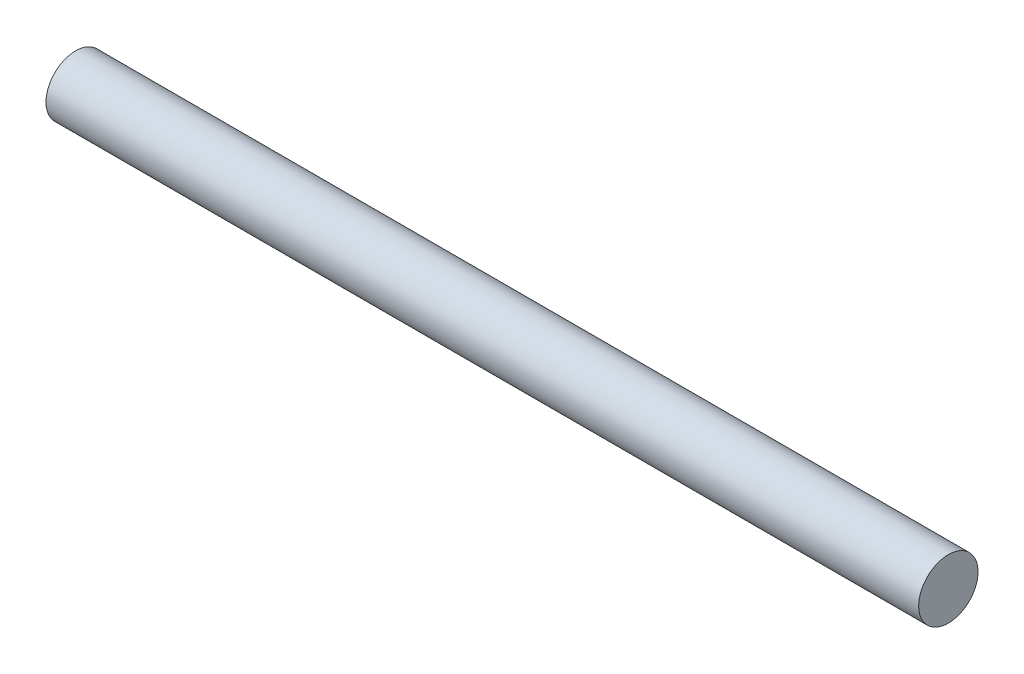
ISO-10303-21;
HEADER;
FILE_DESCRIPTION(('STEP AP214'),'2;1');
FILE_NAME('part.step','',(''),(''),'','','');
FILE_SCHEMA(('AUTOMOTIVE_DESIGN { 1 0 10303 214 1 1 1 1 }'));
ENDSEC;
DATA;
#1=APPLICATION_CONTEXT('core data for automotive mechanical design processes');
#2=APPLICATION_PROTOCOL_DEFINITION('international standard','automotive_design',2000,#1);
#3=PRODUCT_CONTEXT('',#1,'mechanical');
#4=PRODUCT('Part','Part','',(#3));
#5=PRODUCT_RELATED_PRODUCT_CATEGORY('part','',(#4));
#6=PRODUCT_DEFINITION_FORMATION('','',#4);
#7=PRODUCT_DEFINITION_CONTEXT('part definition',#1,'design');
#8=PRODUCT_DEFINITION('design','',#6,#7);
#9=PRODUCT_DEFINITION_SHAPE('','',#8);
#10=(LENGTH_UNIT() NAMED_UNIT(*) SI_UNIT(.MILLI.,.METRE.));
#11=(NAMED_UNIT(*) PLANE_ANGLE_UNIT() SI_UNIT($,.RADIAN.));
#12=(NAMED_UNIT(*) SI_UNIT($,.STERADIAN.) SOLID_ANGLE_UNIT());
#13=UNCERTAINTY_MEASURE_WITH_UNIT(LENGTH_MEASURE(1.E-05),#10,'distance_accuracy_value','');
#14=(GEOMETRIC_REPRESENTATION_CONTEXT(3) GLOBAL_UNCERTAINTY_ASSIGNED_CONTEXT((#13)) GLOBAL_UNIT_ASSIGNED_CONTEXT((#10,
#11,#12)) REPRESENTATION_CONTEXT('',''));
#15=CARTESIAN_POINT('',(0.,0.,0.));
#16=DIRECTION('',(0.,0.,1.));
#17=DIRECTION('',(1.,0.,0.));
#18=AXIS2_PLACEMENT_3D('',#15,#16,#17);
#19=CARTESIAN_POINT('',(0.,0.,0.));
#20=DIRECTION('',(1.,0.,0.));
#21=DIRECTION('',(0.,0.,-1.));
#22=AXIS2_PLACEMENT_3D('',#19,#20,#21);
#23=PLANE('',#22);
#24=CARTESIAN_POINT('',(0.,0.,0.));
#25=DIRECTION('',(-1.,0.,0.));
#26=DIRECTION('',(0.,0.,1.));
#27=AXIS2_PLACEMENT_3D('',#24,#25,#26);
#28=CIRCLE('',#27,4.953);
#29=CARTESIAN_POINT('',(0.,0.,4.953));
#30=VERTEX_POINT('',#29);
#31=EDGE_CURVE('E10',#30,#30,#28,.T.);
#32=ORIENTED_EDGE('',*,*,#31,.T.);
#33=EDGE_LOOP('',(#32));
#34=FACE_BOUND('',#33,.T.);
#35=ADVANCED_FACE('F31',(#34),#23,.F.);
#36=CARTESIAN_POINT('',(145.542,0.,0.));
#37=DIRECTION('',(-1.,0.,0.));
#38=DIRECTION('',(0.,0.,1.));
#39=AXIS2_PLACEMENT_3D('',#36,#37,#38);
#40=CYLINDRICAL_SURFACE('',#39,4.953);
#41=ORIENTED_EDGE('',*,*,#31,.F.);
#42=EDGE_LOOP('',(#41));
#43=FACE_BOUND('',#42,.T.);
#44=CARTESIAN_POINT('',(145.542,0.,0.));
#45=DIRECTION('',(-1.,0.,0.));
#46=DIRECTION('',(0.,0.,1.));
#47=AXIS2_PLACEMENT_3D('',#44,#45,#46);
#48=CIRCLE('',#47,4.953);
#49=CARTESIAN_POINT('',(145.542,0.,4.953));
#50=VERTEX_POINT('',#49);
#51=EDGE_CURVE('E37',#50,#50,#48,.T.);
#52=ORIENTED_EDGE('',*,*,#51,.T.);
#53=EDGE_LOOP('',(#52));
#54=FACE_BOUND('',#53,.T.);
#55=ADVANCED_FACE('F43',(#43,#54),#40,.T.);
#56=CARTESIAN_POINT('',(145.542,4.953,0.));
#57=DIRECTION('',(-1.,0.,0.));
#58=DIRECTION('',(0.,0.,1.));
#59=AXIS2_PLACEMENT_3D('',#56,#57,#58);
#60=PLANE('',#59);
#61=ORIENTED_EDGE('',*,*,#51,.F.);
#62=EDGE_LOOP('',(#61));
#63=FACE_BOUND('',#62,.T.);
#64=ADVANCED_FACE('F45',(#63),#60,.F.);
#65=CLOSED_SHELL('',(#35,#55,#64));
#66=MANIFOLD_SOLID_BREP('B2',#65);
#67=ADVANCED_BREP_SHAPE_REPRESENTATION('',(#18,#66),#14);
#68=SHAPE_DEFINITION_REPRESENTATION(#9,#67);
ENDSEC;
END-ISO-10303-21;
